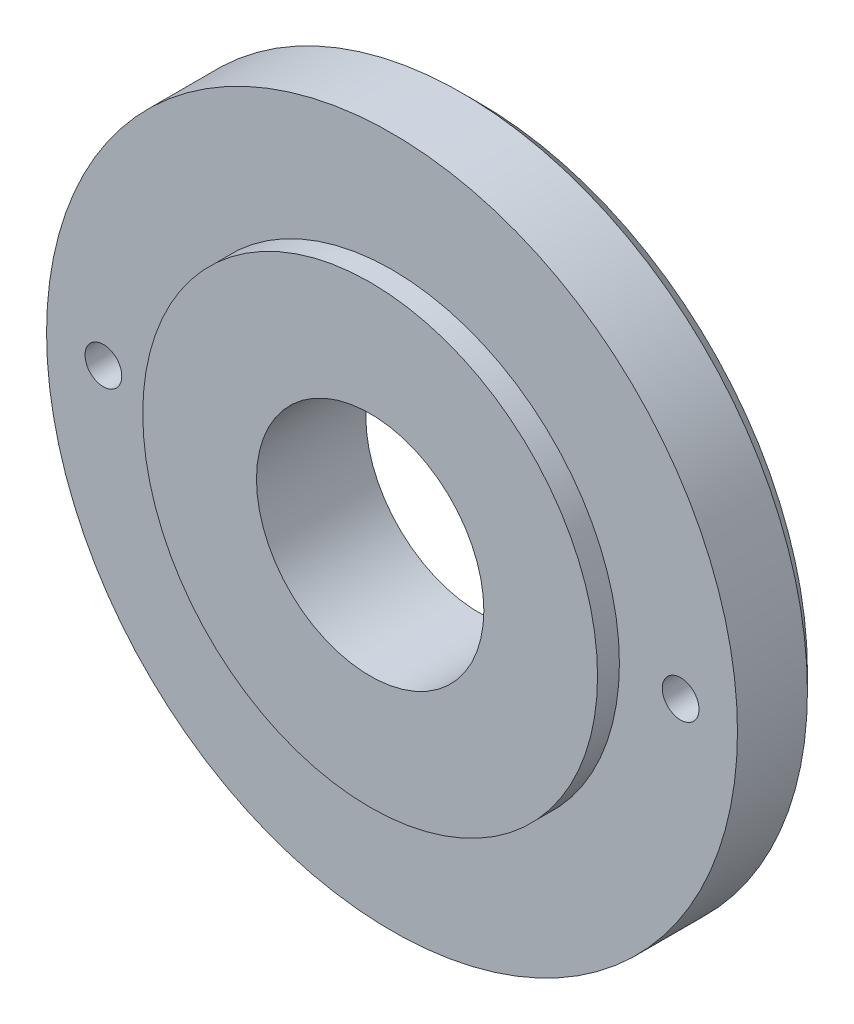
from build123d import *

# Parameters (mm, degrees)
ESQUISSE1_R             = 39.5
ESQUISSE1_R_2           = 13
BASE_EXTRUSION_DEPTH    = 10
ESQUISSE2_R             = 26
ESQUISSE2_R_2           = 13
BOSS_EXTRU_1_DEPTH      = 2.5
CHANFREIN1_SIZE         = 2
ESQUISSE3_R             = 2.1
ENL_V_MAT_EXTRU_1_DEPTH = 58.24290349


with BuildPart() as part:
    # Esquisse1 → Base-Extrusion (new body)
    with BuildSketch(Plane.XY):
        Circle(ESQUISSE1_R)
        Circle(ESQUISSE1_R_2, mode=Mode.SUBTRACT)
    extrude(amount=BASE_EXTRUSION_DEPTH)

    # Esquisse2 → Boss.-Extru.1 (add)
    with BuildSketch(Plane.XY.offset(10)):
        Circle(ESQUISSE2_R)
        Circle(ESQUISSE2_R_2, mode=Mode.SUBTRACT)
    extrude(amount=BOSS_EXTRU_1_DEPTH)

    # Chanfrein1
    chanfrein1_edges = [part.edges().sort_by_distance(p)[0] for p in [
        (-39.5, 0, 0),
    ]]
    chamfer(chanfrein1_edges, length=CHANFREIN1_SIZE)

    # Esquisse3 → Enl_v. mat.-Extru.1 (cut, through all)
    with BuildSketch(Plane(origin=(0, 0, 0), x_dir=(-1, 0, 0), z_dir=(0, 0, -1))):
        with Locations((33, 0)):
            Circle(ESQUISSE3_R)
        with Locations((-33, 0)):
            Circle(ESQUISSE3_R)
    extrude(amount=-ENL_V_MAT_EXTRU_1_DEPTH, mode=Mode.SUBTRACT)


solid = part.part
